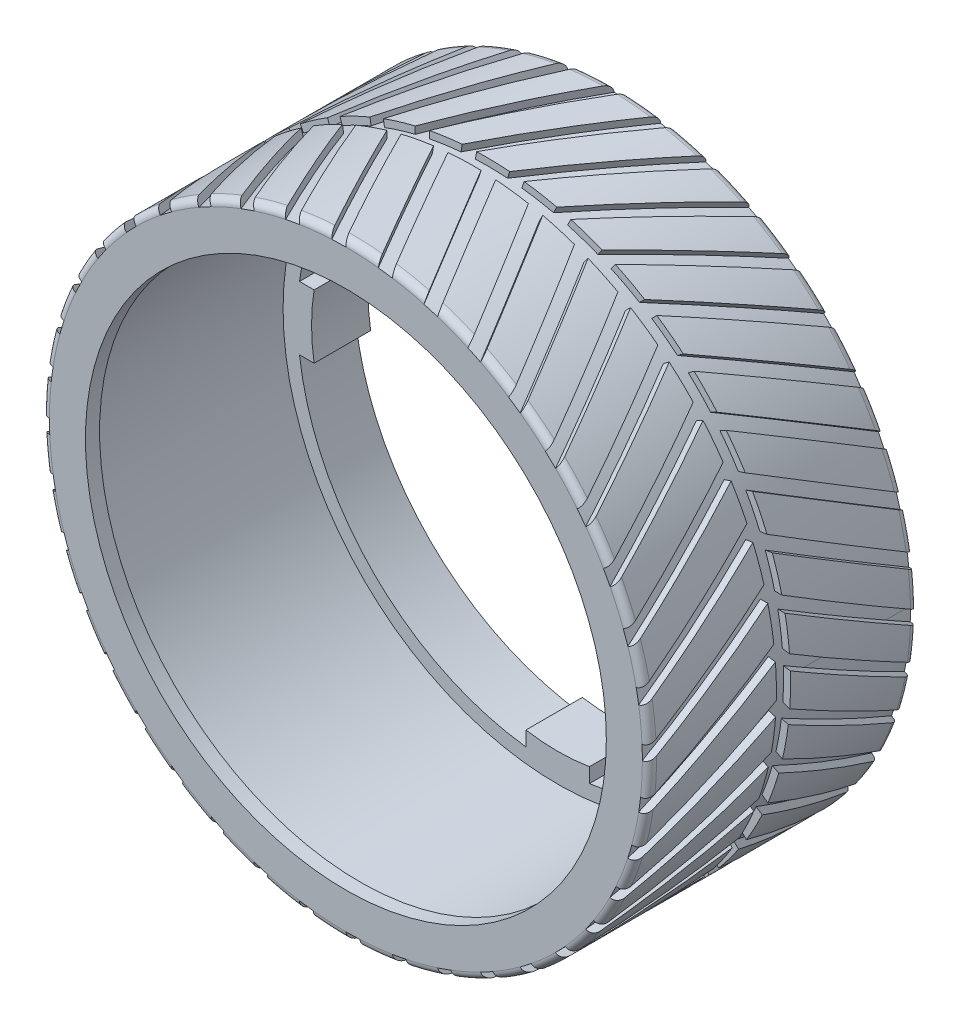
from build123d import *

# Parameters (mm, degrees)
ESQUISSE1_R                  = 21.5
ESQUISSE1_R_2                = 19.45
EXTRUSION1_DEPTH             = 19
EXTRUSION2_START             = -1
ESQUISSE2_R                  = 19.45
ESQUISSE2_R_2                = 18.45
EXTRUSION2_DEPTH             = 1
ESQUISSE4_R                  = 19.45
ESQUISSE4_R_2                = 18.425
EXTRUSION3_DEPTH             = 4
EXTRUSION4_DEPTH             = 4
ENL_V_MAT_EXTRU_1_DEPTH      = 0.5
ENL_V_MAT_EXTRU_1_DEPTH_BACK = 0.5
ESQUISSE6_R                  = 21.5
ESQUISSE6_R_2                = 21
CONG_1_R                     = 0.5
ENL_V_MAT_EXTRU_3_REACH      = 56.215
ENL_V_MAT_EXTRU_3_END_RADIUS = 21
R_P_TITION_CIRCULAIRE1_COUNT = 40


with BuildPart() as part:
    # Esquisse1 → Extrusion1 (new body)
    with BuildSketch(Plane.XY):
        Circle(ESQUISSE1_R)
        Circle(ESQUISSE1_R_2, mode=Mode.SUBTRACT)
    extrude(amount=EXTRUSION1_DEPTH)

    # Esquisse2 → Extrusion2 (add)
    with BuildSketch(Plane.XY.offset(19).offset(EXTRUSION2_START)):
        Circle(ESQUISSE2_R)
        Circle(ESQUISSE2_R_2, mode=Mode.SUBTRACT)
    extrude(amount=EXTRUSION2_DEPTH)

    # Esquisse4 → Extrusion3 (add)
    with BuildSketch(Plane(origin=(0, 0, 0), x_dir=(-1, 0, 0), z_dir=(0, 0, -1))):
        Circle(ESQUISSE4_R)
        Circle(ESQUISSE4_R_2, mode=Mode.SUBTRACT)
    extrude(amount=-EXTRUSION3_DEPTH)

    # Esquisse5 → Extrusion4 (add)
    with BuildSketch(Plane(origin=(0, 0, 0), x_dir=(-1, 0, 0), z_dir=(0, 0, -1))):
        with BuildLine():
            Line((-2.25, 18.75061146), (2.25, 18.75061146))
            Line((2.25, 18.75061146), (2.25, 17.25061146))
            ThreePointArc((2.25, 17.25061146), (0, 17.432718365), (-2.25, 17.25061146))
            Line((-2.25, 17.25061146), (-2.25, 18.75061146))
        make_face()
        with BuildLine():
            Line((18.75061146, 2.25), (18.75061146, -2.25))
            Line((18.75061146, -2.25), (17.25061146, -2.25))
            ThreePointArc((17.25061146, -2.25), (17.432718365, 0), (17.25061146, 2.25))
            Line((17.25061146, 2.25), (18.75061146, 2.25))
        make_face()
        with BuildLine():
            Line((2.25, -18.75061146), (-2.25, -18.75061146))
            Line((-2.25, -18.75061146), (-2.25, -17.25061146))
            ThreePointArc((-2.25, -17.25061146), (0, -17.432718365), (2.25, -17.25061146))
            Line((2.25, -17.25061146), (2.25, -18.75061146))
        make_face()
        with BuildLine():
            Line((-18.75061146, -2.25), (-18.75061146, 2.25))
            Line((-18.75061146, 2.25), (-17.25061146, 2.25))
            ThreePointArc((-17.25061146, 2.25), (-17.432718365, 0), (-17.25061146, -2.25))
            Line((-17.25061146, -2.25), (-18.75061146, -2.25))
        make_face()
    extrude(amount=-EXTRUSION4_DEPTH)

    # Esquisse6 → Enl_v. mat.-Extru.1 (cut, two sides: drawn at the far end of the back side and taken through both)
    with BuildSketch(Plane.XY.offset(9.5).offset(-ENL_V_MAT_EXTRU_1_DEPTH_BACK)):
        Circle(ESQUISSE6_R)
        Circle(ESQUISSE6_R_2, mode=Mode.SUBTRACT)
    extrude(amount=ENL_V_MAT_EXTRU_1_DEPTH + ENL_V_MAT_EXTRU_1_DEPTH_BACK, mode=Mode.SUBTRACT)

    # Cong_1
    cong_1_edges = [part.edges().sort_by_distance(p)[0] for p in [
        (-21.5, 0, 0),
        (-21.5, 0, 19),
    ]]
    fillet(cong_1_edges, radius=CONG_1_R)

    # Enl_v. mat.-Extru.3: up to this cylinder (the profile starts outside it)
    enl_v_mat_extru_3_end = Plane(origin=(0, 0, 9.5), z_dir=(0, 0, 1)) * Cylinder(ENL_V_MAT_EXTRU_3_END_RADIUS, 165.43, mode=Mode.PRIVATE)
    # Esquisse7 → Enl_v. mat.-Extru.3 (cut, up to the surface)
    with BuildSketch(Plane(origin=(24.5, 0, 0), x_dir=(0, 0, -1), z_dir=(1, 0, 0)), mode=Mode.PRIVATE) as enl_v_mat_extru_3_sk1:
        Polygon((-19, 0), (-10, 5.094354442), (-10, 6.094354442), (-19, 1), align=None)
    enl_v_mat_extru_3_tool1 = extrude(enl_v_mat_extru_3_sk1.sketch, amount=-ENL_V_MAT_EXTRU_3_REACH, mode=Mode.PRIVATE) - enl_v_mat_extru_3_end
    # Esquisse7 → Enl_v. mat.-Extru.3 (cut, up to the surface)
    with BuildSketch(Plane(origin=(24.5, 0, 0), x_dir=(0, 0, -1), z_dir=(1, 0, 0)), mode=Mode.PRIVATE) as enl_v_mat_extru_3_sk2:
        Polygon((-9, 5.094354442), (-9, 4.094354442), (0, -1), (0, 0), align=None)
    enl_v_mat_extru_3_tool2 = extrude(enl_v_mat_extru_3_sk2.sketch, amount=-ENL_V_MAT_EXTRU_3_REACH, mode=Mode.PRIVATE) - enl_v_mat_extru_3_end
    enl_v_mat_extru_3 = enl_v_mat_extru_3_tool1.solids().sort_by_distance((24.5, 3.047177, 14.5))[0] + enl_v_mat_extru_3_tool2.solids().sort_by_distance((24.5, 2.047177, 4.5))[0]
    add(enl_v_mat_extru_3, mode=Mode.SUBTRACT)

    # R_p_tition circulaire1: Enl_v. mat.-Extru.3 ×40 about axis
    r_p_tition_circulaire1_axis = Axis((0, 0, 0), (0, 0, 1))
    for i in range(1, R_P_TITION_CIRCULAIRE1_COUNT):
        add(enl_v_mat_extru_3.rotate(r_p_tition_circulaire1_axis, i * 360 / R_P_TITION_CIRCULAIRE1_COUNT), mode=Mode.SUBTRACT)


solid = part.part
